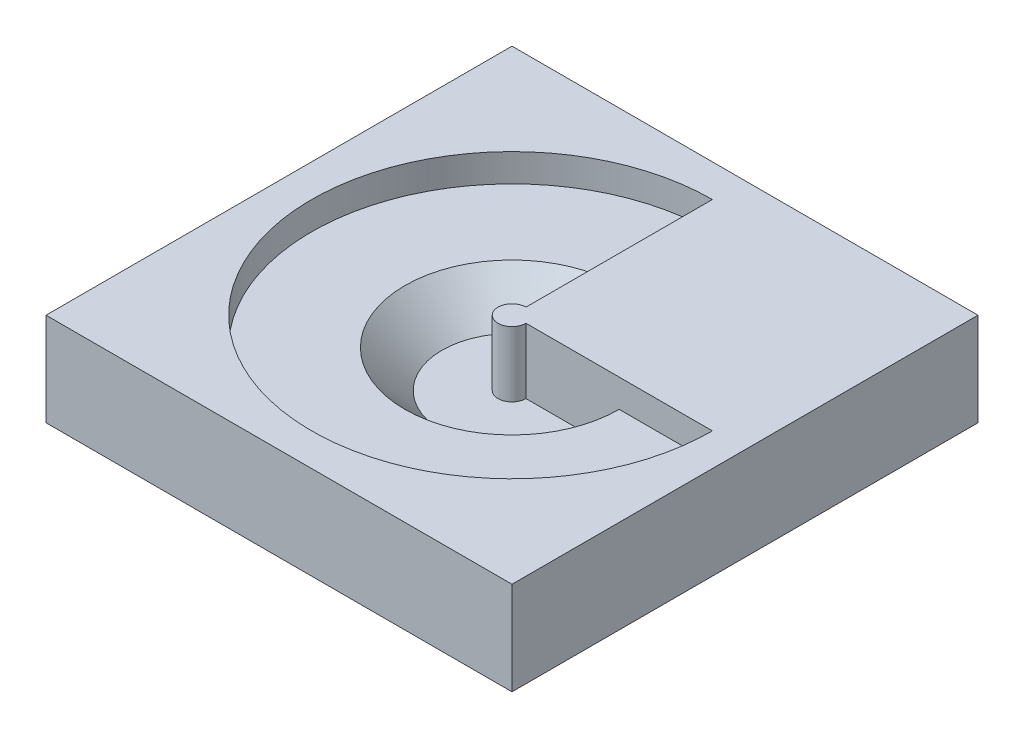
from build123d import *

# Parameters (mm, degrees)
SKETCH1_W                    = 100
SKETCH1_H                    = 100
EXTRUDE1_DEPTH               = 10
CUT_REVOLVE1_ANGLE           = 90
CUT_REVOLVE1_OTHER_WAY_ANGLE = 180


with BuildPart() as part:
    # Sketch1 → Extrude1 (new, symmetric)
    with BuildSketch(Plane(origin=(0, 0, 0), x_dir=(1, 0, 0), z_dir=(0, 1, 0))):
        Rectangle(SKETCH1_W, SKETCH1_H)
    extrude(amount=EXTRUDE1_DEPTH, both=True)

    # Sketch2 → Cut-Revolve1 (revolve, cut)
    with BuildSketch(Plane.XY):
        Polygon((-3, 10), (-3, -4), (-15, -4), (-23, 4), (-43, 4), (-43, 10), align=None)
    revolve(axis=Axis((0, 0, 0), (0, -1, 0)), revolution_arc=CUT_REVOLVE1_ANGLE, mode=Mode.SUBTRACT)

    # Sketch2 → Cut-Revolve1 other way (revolve, cut)
    with BuildSketch(Plane.XY):
        Polygon((-3, 10), (-3, -4), (-15, -4), (-23, 4), (-43, 4), (-43, 10), align=None)
    revolve(axis=Axis((0, 0, 0), (0, 1, 0)), revolution_arc=CUT_REVOLVE1_OTHER_WAY_ANGLE, mode=Mode.SUBTRACT)


solid = part.part
